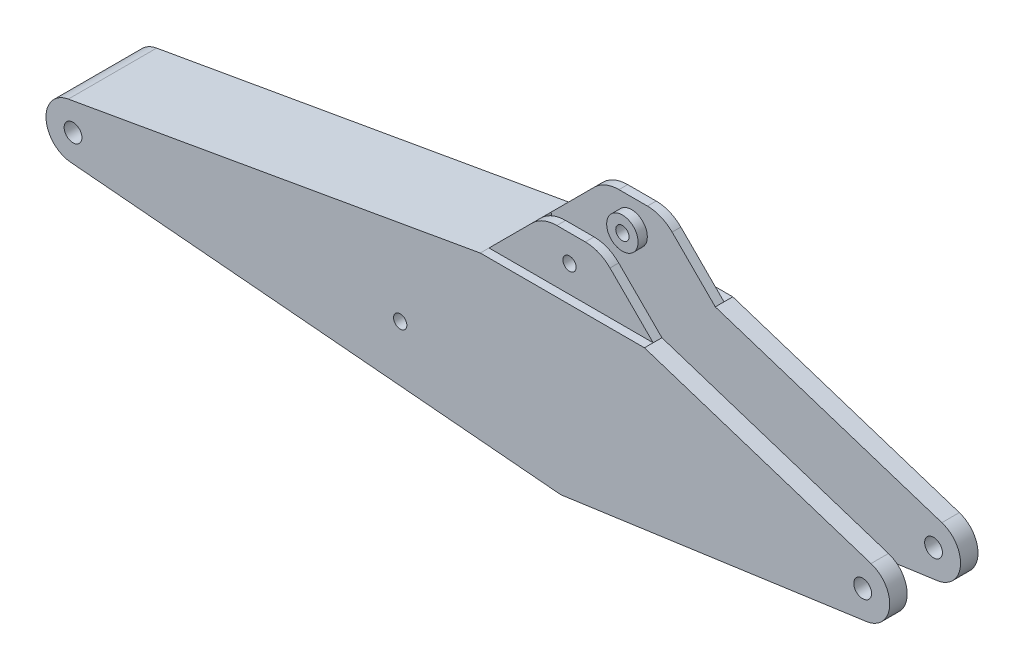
from build123d import *

# Parameters (mm, degrees)
SKETCH1_R               = 90
SKETCH1_R_2             = 155
SKETCH1_R_3             = 51
BOSS_EXTRUDE1_DEPTH     = 253
FILLET1_R               = 200
CUT_EXTRUDE1_DEPTH      = 153
SKETCH3_R               = 90
BOSS_EXTRUDE3_DEPTH     = 53
SKETCH4_R               = 38
CUT_EXTRUDE2_DEPTH      = 3119.358702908
CUT_EXTRUDE3_START      = -50
CUT_EXTRUDE3_DEPTH      = 50
SKETCH6_R               = 90
BOSS_EXTRUDE4_DEPTH     = 53
CUT_EXTRUDE4_DEPTH      = 3119.358702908
CUT_EXTRUDE4_DEPTH_BACK = 3119.358702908
SKETCH7_R               = 38


with BuildPart() as part:
    # Sketch1 → Boss-Extrude1 (new, symmetric)
    # profile 1 of 4: a face of its own
    with BuildSketch(Plane.XY):
        with BuildLine():
            Line((1777.869484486, 147.422903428), (479.545087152, 569))
            Line((479.545087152, 569), (173.545087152, 875))
            Line((173.545087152, 875), (-155.249509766, 875))
            Line((-155.249509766, 875), (-461.249509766, 569))
            Line((-461.249509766, 569), (-2821.922095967, 152.644032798))
            ThreePointArc((-2821.922095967, 152.644032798), (-2695.370498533, 118.739051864), (-2640, 0))
            ThreePointArc((-2640, 0), (-2690.281036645, -114.275713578), (-2808.502435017, -154.410764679))
            Line((-2808.502435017, -154.410764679), (0, -400))
            Line((0, -400), (1751.601139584, -153.487428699))
            ThreePointArc((1751.601139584, -153.487428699), (1575.58724503, 13.479655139), (1777.869484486, 147.422903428))
        make_face()
        with Locations((0, 722)):
            Circle(SKETCH1_R, mode=Mode.SUBTRACT)
    # profile 2 of 4: a face of its own
    with BuildSketch(Plane.XY):
        with Locations((0, 722)):
            Circle(SKETCH1_R)
    # profile 3 of 4: a face of its own
    with BuildSketch(Plane.XY):
        with Locations((1730, 0)):
            Circle(SKETCH1_R_2)
        with Locations((1730, 0)):
            Circle(SKETCH1_R_3, mode=Mode.SUBTRACT)
    # profile 4 of 4: a face of its own
    with BuildSketch(Plane.XY):
        with Locations((-2795, 0)):
            Circle(SKETCH1_R_2)
        with Locations((-2795, 0)):
            Circle(SKETCH1_R_3, mode=Mode.SUBTRACT)
    extrude(amount=BOSS_EXTRUDE1_DEPTH, both=True)

    # Fillet1
    fillet1_edges = [part.edges().sort_by_distance(p)[0] for p in [
        (-155.249509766, 875, 0),
        (173.545087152, 875, 0),
    ]]
    fillet(fillet1_edges, radius=FILLET1_R)

    # Sketch2 → Cut-Extrude1 (cut, symmetric)
    with BuildSketch(Plane.XY):
        with BuildLine():
            Line((-461.249509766, 569), (-454.301872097, 529.607991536))
            Line((-454.301872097, 529.607991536), (-2814.974458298, 113.252024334))
            ThreePointArc((-2814.974458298, 113.252024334), (-2909.890327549, -5.021218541), (-2805.017935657, -114.562825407))
            Line((-2805.017935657, -114.562825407), (-1.058577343, -359.754791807))
            Line((-1.058577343, -359.754791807), (1024, -215.492596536))
            Line((1024, -215.492596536), (1024, -255.886784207))
            Line((1024, -255.886784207), (1751.601139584, -153.487428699))
            ThreePointArc((1751.601139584, -153.487428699), (1884.41275497, -13.479655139), (1777.869484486, 147.422903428))
            Line((1777.869484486, 147.422903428), (479.545087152, 569))
            Line((479.545087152, 569), (232.123730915, 816.421356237))
            ThreePointArc((232.123730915, 816.421356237), (167.23906115, 859.775906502), (90.702374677, 875))
            Line((90.702374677, 875), (-72.406797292, 875))
            ThreePointArc((-72.406797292, 875), (-148.943483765, 859.775906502), (-213.828153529, 816.421356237))
            Line((-213.828153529, 816.421356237), (-461.249509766, 569))
        make_face()
    extrude(amount=CUT_EXTRUDE1_DEPTH, both=True, mode=Mode.SUBTRACT)

    # Sketch3 → Boss-Extrude3 (add)
    with BuildSketch(Plane(origin=(0, 0, 153), x_dir=(-1, 0, 0), z_dir=(0, 0, -1))):
        with Locations(Location((0, 722, 0), (0, 0, 180))):
            Circle(SKETCH3_R)
    boss_extrude3 = extrude(amount=BOSS_EXTRUDE3_DEPTH)

    # Mirror1: Boss-Extrude3 across plane
    add(boss_extrude3.mirror(Plane.XY))

    # Sketch4 → Cut-Extrude2 (cut, through all)
    with BuildSketch(Plane(origin=(0, 0, -253), x_dir=(-1, 0, 0), z_dir=(0, 0, -1))):
        with Locations((0, 722)):
            Circle(SKETCH4_R)
    extrude(amount=-CUT_EXTRUDE2_DEPTH, mode=Mode.SUBTRACT)

    # Sketch5 → Cut-Extrude3 (cut)
    with BuildSketch(Plane(origin=(0, 0, -253), x_dir=(-1, 0, 0), z_dir=(0, 0, -1)).offset(CUT_EXTRUDE3_START)):
        with BuildLine():
            Line((-479.545087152, 569), (461.249509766, 569))
            Line((461.249509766, 569), (213.828153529, 816.421356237))
            ThreePointArc((213.828153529, 816.421356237), (148.943483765, 859.775906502), (72.406797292, 875))
            Line((72.406797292, 875), (-90.702374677, 875))
            ThreePointArc((-90.702374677, 875), (-167.23906115, 859.775906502), (-232.123730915, 816.421356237))
            Line((-232.123730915, 816.421356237), (-479.545087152, 569))
        make_face()
    cut_extrude3 = extrude(amount=CUT_EXTRUDE3_DEPTH, mode=Mode.SUBTRACT)

    # Mirror2: Cut-Extrude3 across plane
    add(cut_extrude3.mirror(Plane.XY), mode=Mode.SUBTRACT)

    # Sketch6 → Boss-Extrude4 (add)
    with BuildSketch(Plane(origin=(0, 0, 153), x_dir=(-1, 0, 0), z_dir=(0, 0, -1))):
        with Locations(Location((920, 0, 0), (0, 0, 180))):
            Circle(SKETCH6_R)
    boss_extrude4 = extrude(amount=BOSS_EXTRUDE4_DEPTH)

    # Mirror3: Boss-Extrude4 across plane
    add(boss_extrude4.mirror(Plane.XY))

    # Sketch7 → Cut-Extrude4 (cut, two sides: drawn at the far end of the back side and taken through both)
    with BuildSketch(Plane.XY.offset(253).offset(-CUT_EXTRUDE4_DEPTH_BACK)):
        with Locations((-920, 0)):
            Circle(SKETCH7_R)
    extrude(amount=CUT_EXTRUDE4_DEPTH + CUT_EXTRUDE4_DEPTH_BACK, mode=Mode.SUBTRACT)


solid = part.part
